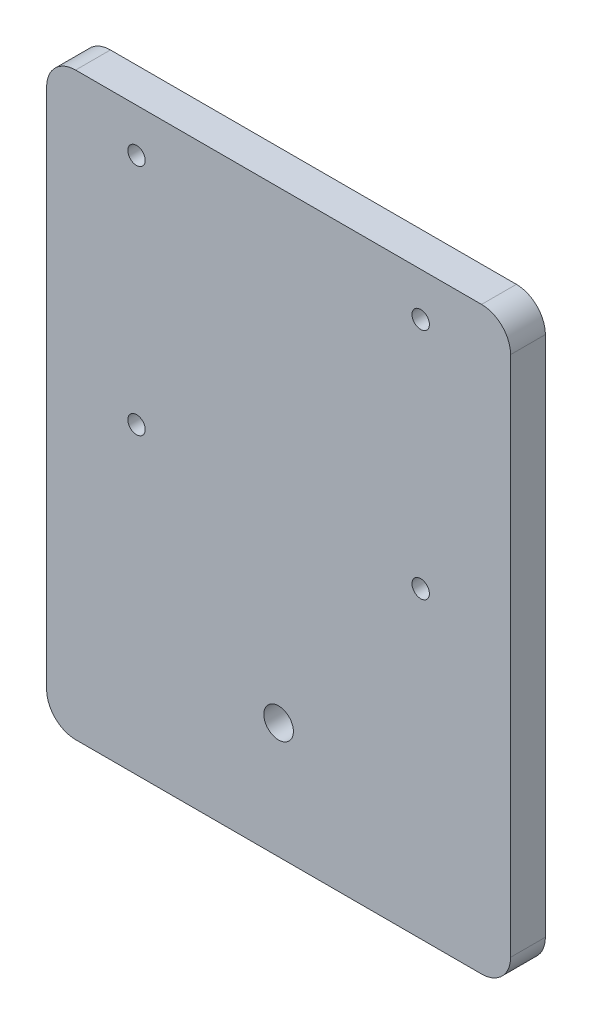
ISO-10303-21;
HEADER;
FILE_DESCRIPTION(('STEP AP214'),'2;1');
FILE_NAME('part.step','',(''),(''),'','','');
FILE_SCHEMA(('AUTOMOTIVE_DESIGN { 1 0 10303 214 1 1 1 1 }'));
ENDSEC;
DATA;
#1=APPLICATION_CONTEXT('core data for automotive mechanical design processes');
#2=APPLICATION_PROTOCOL_DEFINITION('international standard','automotive_design',2000,#1);
#3=PRODUCT_CONTEXT('',#1,'mechanical');
#4=PRODUCT('Part','Part','',(#3));
#5=PRODUCT_RELATED_PRODUCT_CATEGORY('part','',(#4));
#6=PRODUCT_DEFINITION_FORMATION('','',#4);
#7=PRODUCT_DEFINITION_CONTEXT('part definition',#1,'design');
#8=PRODUCT_DEFINITION('design','',#6,#7);
#9=PRODUCT_DEFINITION_SHAPE('','',#8);
#10=(LENGTH_UNIT() NAMED_UNIT(*) SI_UNIT(.MILLI.,.METRE.));
#11=(NAMED_UNIT(*) PLANE_ANGLE_UNIT() SI_UNIT($,.RADIAN.));
#12=(NAMED_UNIT(*) SI_UNIT($,.STERADIAN.) SOLID_ANGLE_UNIT());
#13=UNCERTAINTY_MEASURE_WITH_UNIT(LENGTH_MEASURE(1.E-05),#10,'distance_accuracy_value','');
#14=(GEOMETRIC_REPRESENTATION_CONTEXT(3) GLOBAL_UNCERTAINTY_ASSIGNED_CONTEXT((#13)) GLOBAL_UNIT_ASSIGNED_CONTEXT((#10,
#11,#12)) REPRESENTATION_CONTEXT('',''));
#15=CARTESIAN_POINT('',(0.,0.,0.));
#16=DIRECTION('',(0.,0.,1.));
#17=DIRECTION('',(1.,0.,0.));
#18=AXIS2_PLACEMENT_3D('',#15,#16,#17);
#19=CARTESIAN_POINT('',(40.,-50.,6.));
#20=DIRECTION('',(-1.,0.,0.));
#21=DIRECTION('',(0.,0.,1.));
#22=AXIS2_PLACEMENT_3D('',#19,#20,#21);
#23=PLANE('',#22);
#24=DIRECTION('',(0.,1.,0.));
#25=VECTOR('',#24,1.);
#26=CARTESIAN_POINT('',(40.,-50.,6.));
#27=LINE('',#26,#25);
#28=CARTESIAN_POINT('',(40.,-45.,6.));
#29=VERTEX_POINT('',#28);
#30=CARTESIAN_POINT('',(40.,45.,6.));
#31=VERTEX_POINT('',#30);
#32=EDGE_CURVE('E128',#29,#31,#27,.T.);
#33=ORIENTED_EDGE('',*,*,#32,.F.);
#34=DIRECTION('',(0.,0.,-1.));
#35=VECTOR('',#34,1.);
#36=CARTESIAN_POINT('',(40.,-45.,6.));
#37=LINE('',#36,#35);
#38=CARTESIAN_POINT('',(40.,-45.,0.));
#39=VERTEX_POINT('',#38);
#40=EDGE_CURVE('E11',#29,#39,#37,.T.);
#41=ORIENTED_EDGE('',*,*,#40,.T.);
#42=DIRECTION('',(0.,1.,0.));
#43=VECTOR('',#42,1.);
#44=CARTESIAN_POINT('',(40.,-50.,0.));
#45=LINE('',#44,#43);
#46=CARTESIAN_POINT('',(40.,45.,0.));
#47=VERTEX_POINT('',#46);
#48=EDGE_CURVE('E130',#39,#47,#45,.T.);
#49=ORIENTED_EDGE('',*,*,#48,.T.);
#50=DIRECTION('',(0.,0.,-1.));
#51=VECTOR('',#50,1.);
#52=CARTESIAN_POINT('',(40.,45.,6.));
#53=LINE('',#52,#51);
#54=EDGE_CURVE('E41',#47,#31,#53,.F.);
#55=ORIENTED_EDGE('',*,*,#54,.T.);
#56=EDGE_LOOP('',(#33,#41,#49,#55));
#57=FACE_BOUND('',#56,.T.);
#58=ADVANCED_FACE('F33',(#57),#23,.F.);
#59=CARTESIAN_POINT('',(-40.,50.,6.));
#60=DIRECTION('',(0.,-1.,0.));
#61=DIRECTION('',(0.,0.,-1.));
#62=AXIS2_PLACEMENT_3D('',#59,#60,#61);
#63=PLANE('',#62);
#64=DIRECTION('',(-1.,0.,0.));
#65=VECTOR('',#64,1.);
#66=CARTESIAN_POINT('',(-40.,50.,0.));
#67=LINE('',#66,#65);
#68=CARTESIAN_POINT('',(35.,50.,0.));
#69=VERTEX_POINT('',#68);
#70=CARTESIAN_POINT('',(-35.,50.,0.));
#71=VERTEX_POINT('',#70);
#72=EDGE_CURVE('E126',#69,#71,#67,.T.);
#73=ORIENTED_EDGE('',*,*,#72,.T.);
#74=DIRECTION('',(0.,0.,-1.));
#75=VECTOR('',#74,1.);
#76=CARTESIAN_POINT('',(-35.,50.,6.));
#77=LINE('',#76,#75);
#78=CARTESIAN_POINT('',(-35.,50.,6.));
#79=VERTEX_POINT('',#78);
#80=EDGE_CURVE('E105',#71,#79,#77,.F.);
#81=ORIENTED_EDGE('',*,*,#80,.T.);
#82=DIRECTION('',(-1.,0.,0.));
#83=VECTOR('',#82,1.);
#84=CARTESIAN_POINT('',(-40.,50.,6.));
#85=LINE('',#84,#83);
#86=CARTESIAN_POINT('',(35.,50.,6.));
#87=VERTEX_POINT('',#86);
#88=EDGE_CURVE('E166',#87,#79,#85,.T.);
#89=ORIENTED_EDGE('',*,*,#88,.F.);
#90=DIRECTION('',(0.,0.,-1.));
#91=VECTOR('',#90,1.);
#92=CARTESIAN_POINT('',(35.,50.,6.));
#93=LINE('',#92,#91);
#94=EDGE_CURVE('E110',#87,#69,#93,.T.);
#95=ORIENTED_EDGE('',*,*,#94,.T.);
#96=EDGE_LOOP('',(#73,#81,#89,#95));
#97=FACE_BOUND('',#96,.T.);
#98=ADVANCED_FACE('F170',(#97),#63,.F.);
#99=CARTESIAN_POINT('',(-40.,-50.,6.));
#100=DIRECTION('',(1.,0.,0.));
#101=DIRECTION('',(0.,0.,-1.));
#102=AXIS2_PLACEMENT_3D('',#99,#100,#101);
#103=PLANE('',#102);
#104=DIRECTION('',(0.,-1.,0.));
#105=VECTOR('',#104,1.);
#106=CARTESIAN_POINT('',(-40.,-50.,6.));
#107=LINE('',#106,#105);
#108=CARTESIAN_POINT('',(-40.,45.,6.));
#109=VERTEX_POINT('',#108);
#110=CARTESIAN_POINT('',(-40.,-45.,6.));
#111=VERTEX_POINT('',#110);
#112=EDGE_CURVE('E119',#109,#111,#107,.T.);
#113=ORIENTED_EDGE('',*,*,#112,.F.);
#114=DIRECTION('',(0.,0.,-1.));
#115=VECTOR('',#114,1.);
#116=CARTESIAN_POINT('',(-40.,45.,6.));
#117=LINE('',#116,#115);
#118=CARTESIAN_POINT('',(-40.,45.,0.));
#119=VERTEX_POINT('',#118);
#120=EDGE_CURVE('E104',#109,#119,#117,.T.);
#121=ORIENTED_EDGE('',*,*,#120,.T.);
#122=DIRECTION('',(0.,-1.,0.));
#123=VECTOR('',#122,1.);
#124=CARTESIAN_POINT('',(-40.,-50.,0.));
#125=LINE('',#124,#123);
#126=CARTESIAN_POINT('',(-40.,-45.,0.));
#127=VERTEX_POINT('',#126);
#128=EDGE_CURVE('E117',#119,#127,#125,.T.);
#129=ORIENTED_EDGE('',*,*,#128,.T.);
#130=DIRECTION('',(0.,0.,-1.));
#131=VECTOR('',#130,1.);
#132=CARTESIAN_POINT('',(-40.,-45.,6.));
#133=LINE('',#132,#131);
#134=EDGE_CURVE('E121',#127,#111,#133,.F.);
#135=ORIENTED_EDGE('',*,*,#134,.T.);
#136=EDGE_LOOP('',(#113,#121,#129,#135));
#137=FACE_BOUND('',#136,.T.);
#138=ADVANCED_FACE('F116',(#137),#103,.F.);
#139=CARTESIAN_POINT('',(-40.,-50.,6.));
#140=DIRECTION('',(0.,1.,0.));
#141=DIRECTION('',(0.,0.,1.));
#142=AXIS2_PLACEMENT_3D('',#139,#140,#141);
#143=PLANE('',#142);
#144=DIRECTION('',(1.,0.,0.));
#145=VECTOR('',#144,1.);
#146=CARTESIAN_POINT('',(-40.,-50.,6.));
#147=LINE('',#146,#145);
#148=CARTESIAN_POINT('',(-35.,-50.,6.));
#149=VERTEX_POINT('',#148);
#150=CARTESIAN_POINT('',(35.,-50.,6.));
#151=VERTEX_POINT('',#150);
#152=EDGE_CURVE('E134',#149,#151,#147,.T.);
#153=ORIENTED_EDGE('',*,*,#152,.F.);
#154=DIRECTION('',(0.,0.,-1.));
#155=VECTOR('',#154,1.);
#156=CARTESIAN_POINT('',(-35.,-50.,6.));
#157=LINE('',#156,#155);
#158=CARTESIAN_POINT('',(-35.,-50.,0.));
#159=VERTEX_POINT('',#158);
#160=EDGE_CURVE('E151',#149,#159,#157,.T.);
#161=ORIENTED_EDGE('',*,*,#160,.T.);
#162=DIRECTION('',(1.,0.,0.));
#163=VECTOR('',#162,1.);
#164=CARTESIAN_POINT('',(-40.,-50.,0.));
#165=LINE('',#164,#163);
#166=CARTESIAN_POINT('',(35.,-50.,0.));
#167=VERTEX_POINT('',#166);
#168=EDGE_CURVE('E125',#159,#167,#165,.T.);
#169=ORIENTED_EDGE('',*,*,#168,.T.);
#170=DIRECTION('',(0.,0.,-1.));
#171=VECTOR('',#170,1.);
#172=CARTESIAN_POINT('',(35.,-50.,6.));
#173=LINE('',#172,#171);
#174=EDGE_CURVE('E48',#167,#151,#173,.F.);
#175=ORIENTED_EDGE('',*,*,#174,.T.);
#176=EDGE_LOOP('',(#153,#161,#169,#175));
#177=FACE_BOUND('',#176,.T.);
#178=ADVANCED_FACE('F228',(#177),#143,.F.);
#179=CARTESIAN_POINT('',(0.,0.,6.));
#180=DIRECTION('',(0.,0.,-1.));
#181=DIRECTION('',(-1.,0.,0.));
#182=AXIS2_PLACEMENT_3D('',#179,#180,#181);
#183=PLANE('',#182);
#184=CARTESIAN_POINT('',(-24.4999999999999,42.5011886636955,6.));
#185=DIRECTION('',(0.,0.,-1.));
#186=DIRECTION('',(-1.,0.,0.));
#187=AXIS2_PLACEMENT_3D('',#184,#185,#186);
#188=CIRCLE('',#187,1.5);
#189=CARTESIAN_POINT('',(-25.9999999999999,42.5011886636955,6.));
#190=VERTEX_POINT('',#189);
#191=EDGE_CURVE('E187',#190,#190,#188,.T.);
#192=ORIENTED_EDGE('',*,*,#191,.T.);
#193=EDGE_LOOP('',(#192));
#194=FACE_BOUND('',#193,.T.);
#195=CARTESIAN_POINT('',(24.5,2.29881133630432,6.));
#196=DIRECTION('',(0.,0.,-1.));
#197=DIRECTION('',(-1.,0.,0.));
#198=AXIS2_PLACEMENT_3D('',#195,#196,#197);
#199=CIRCLE('',#198,1.5);
#200=CARTESIAN_POINT('',(23.,2.29881133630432,6.));
#201=VERTEX_POINT('',#200);
#202=EDGE_CURVE('E190',#201,#201,#199,.T.);
#203=ORIENTED_EDGE('',*,*,#202,.T.);
#204=EDGE_LOOP('',(#203));
#205=FACE_BOUND('',#204,.T.);
#206=CARTESIAN_POINT('',(24.5,42.5011886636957,6.));
#207=DIRECTION('',(0.,0.,-1.));
#208=DIRECTION('',(-1.,0.,0.));
#209=AXIS2_PLACEMENT_3D('',#206,#207,#208);
#210=CIRCLE('',#209,1.5);
#211=CARTESIAN_POINT('',(23.,42.5011886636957,6.));
#212=VERTEX_POINT('',#211);
#213=EDGE_CURVE('E193',#212,#212,#210,.T.);
#214=ORIENTED_EDGE('',*,*,#213,.T.);
#215=EDGE_LOOP('',(#214));
#216=FACE_BOUND('',#215,.T.);
#217=CARTESIAN_POINT('',(-24.5,2.29881133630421,6.));
#218=DIRECTION('',(0.,0.,-1.));
#219=DIRECTION('',(-1.,0.,0.));
#220=AXIS2_PLACEMENT_3D('',#217,#218,#219);
#221=CIRCLE('',#220,1.5);
#222=CARTESIAN_POINT('',(-26.,2.29881133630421,6.));
#223=VERTEX_POINT('',#222);
#224=EDGE_CURVE('E180',#223,#223,#221,.T.);
#225=ORIENTED_EDGE('',*,*,#224,.T.);
#226=EDGE_LOOP('',(#225));
#227=FACE_BOUND('',#226,.T.);
#228=CARTESIAN_POINT('',(0.,-30.,6.));
#229=DIRECTION('',(0.,0.,1.));
#230=DIRECTION('',(1.,0.,0.));
#231=AXIS2_PLACEMENT_3D('',#228,#229,#230);
#232=CIRCLE('',#231,2.55);
#233=CARTESIAN_POINT('',(2.55,-30.,6.));
#234=VERTEX_POINT('',#233);
#235=EDGE_CURVE('E173',#234,#234,#232,.T.);
#236=ORIENTED_EDGE('',*,*,#235,.F.);
#237=EDGE_LOOP('',(#236));
#238=FACE_BOUND('',#237,.T.);
#239=ORIENTED_EDGE('',*,*,#88,.T.);
#240=CARTESIAN_POINT('',(-35.,45.,6.));
#241=DIRECTION('',(0.,0.,-1.));
#242=DIRECTION('',(-1.,0.,0.));
#243=AXIS2_PLACEMENT_3D('',#240,#241,#242);
#244=CIRCLE('',#243,5.);
#245=EDGE_CURVE('E148',#79,#109,#244,.F.);
#246=ORIENTED_EDGE('',*,*,#245,.T.);
#247=ORIENTED_EDGE('',*,*,#112,.T.);
#248=CARTESIAN_POINT('',(-35.,-45.,6.));
#249=DIRECTION('',(0.,0.,-1.));
#250=DIRECTION('',(-1.,0.,0.));
#251=AXIS2_PLACEMENT_3D('',#248,#249,#250);
#252=CIRCLE('',#251,5.);
#253=EDGE_CURVE('E55',#111,#149,#252,.F.);
#254=ORIENTED_EDGE('',*,*,#253,.T.);
#255=ORIENTED_EDGE('',*,*,#152,.T.);
#256=CARTESIAN_POINT('',(35.,-45.,6.));
#257=DIRECTION('',(0.,0.,-1.));
#258=DIRECTION('',(-1.,0.,0.));
#259=AXIS2_PLACEMENT_3D('',#256,#257,#258);
#260=CIRCLE('',#259,5.);
#261=EDGE_CURVE('E145',#151,#29,#260,.F.);
#262=ORIENTED_EDGE('',*,*,#261,.T.);
#263=ORIENTED_EDGE('',*,*,#32,.T.);
#264=CARTESIAN_POINT('',(35.,45.,6.));
#265=DIRECTION('',(0.,0.,-1.));
#266=DIRECTION('',(-1.,0.,0.));
#267=AXIS2_PLACEMENT_3D('',#264,#265,#266);
#268=CIRCLE('',#267,5.);
#269=EDGE_CURVE('E143',#31,#87,#268,.F.);
#270=ORIENTED_EDGE('',*,*,#269,.T.);
#271=EDGE_LOOP('',(#239,#246,#247,#254,#255,#262,#263,#270));
#272=FACE_BOUND('',#271,.T.);
#273=ADVANCED_FACE('F163',(#194,#205,#216,#227,#238,#272),#183,.F.);
#274=CARTESIAN_POINT('',(0.,0.,0.));
#275=DIRECTION('',(0.,0.,-1.));
#276=DIRECTION('',(-1.,0.,0.));
#277=AXIS2_PLACEMENT_3D('',#274,#275,#276);
#278=PLANE('',#277);
#279=CARTESIAN_POINT('',(-24.4999999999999,42.5011886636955,0.));
#280=DIRECTION('',(0.,0.,-1.));
#281=DIRECTION('',(-1.,0.,0.));
#282=AXIS2_PLACEMENT_3D('',#279,#280,#281);
#283=CIRCLE('',#282,1.5);
#284=CARTESIAN_POINT('',(-25.9999999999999,42.5011886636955,0.));
#285=VERTEX_POINT('',#284);
#286=EDGE_CURVE('E196',#285,#285,#283,.T.);
#287=ORIENTED_EDGE('',*,*,#286,.F.);
#288=EDGE_LOOP('',(#287));
#289=FACE_BOUND('',#288,.T.);
#290=CARTESIAN_POINT('',(24.5,2.29881133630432,0.));
#291=DIRECTION('',(0.,0.,-1.));
#292=DIRECTION('',(-1.,0.,0.));
#293=AXIS2_PLACEMENT_3D('',#290,#291,#292);
#294=CIRCLE('',#293,1.5);
#295=CARTESIAN_POINT('',(23.,2.29881133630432,0.));
#296=VERTEX_POINT('',#295);
#297=EDGE_CURVE('E200',#296,#296,#294,.T.);
#298=ORIENTED_EDGE('',*,*,#297,.F.);
#299=EDGE_LOOP('',(#298));
#300=FACE_BOUND('',#299,.T.);
#301=CARTESIAN_POINT('',(24.5,42.5011886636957,0.));
#302=DIRECTION('',(0.,0.,-1.));
#303=DIRECTION('',(-1.,0.,0.));
#304=AXIS2_PLACEMENT_3D('',#301,#302,#303);
#305=CIRCLE('',#304,1.5);
#306=CARTESIAN_POINT('',(23.,42.5011886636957,0.));
#307=VERTEX_POINT('',#306);
#308=EDGE_CURVE('E197',#307,#307,#305,.T.);
#309=ORIENTED_EDGE('',*,*,#308,.F.);
#310=EDGE_LOOP('',(#309));
#311=FACE_BOUND('',#310,.T.);
#312=CARTESIAN_POINT('',(-24.5,2.29881133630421,0.));
#313=DIRECTION('',(0.,0.,-1.));
#314=DIRECTION('',(-1.,0.,0.));
#315=AXIS2_PLACEMENT_3D('',#312,#313,#314);
#316=CIRCLE('',#315,1.5);
#317=CARTESIAN_POINT('',(-26.,2.29881133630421,0.));
#318=VERTEX_POINT('',#317);
#319=EDGE_CURVE('E184',#318,#318,#316,.T.);
#320=ORIENTED_EDGE('',*,*,#319,.F.);
#321=EDGE_LOOP('',(#320));
#322=FACE_BOUND('',#321,.T.);
#323=CARTESIAN_POINT('',(0.,-30.,0.));
#324=DIRECTION('',(0.,0.,1.));
#325=DIRECTION('',(1.,0.,0.));
#326=AXIS2_PLACEMENT_3D('',#323,#324,#325);
#327=CIRCLE('',#326,2.55);
#328=CARTESIAN_POINT('',(2.55,-30.,0.));
#329=VERTEX_POINT('',#328);
#330=EDGE_CURVE('E171',#329,#329,#327,.T.);
#331=ORIENTED_EDGE('',*,*,#330,.T.);
#332=EDGE_LOOP('',(#331));
#333=FACE_BOUND('',#332,.T.);
#334=ORIENTED_EDGE('',*,*,#128,.F.);
#335=CARTESIAN_POINT('',(-35.,45.,0.));
#336=DIRECTION('',(0.,0.,-1.));
#337=DIRECTION('',(-1.,0.,0.));
#338=AXIS2_PLACEMENT_3D('',#335,#336,#337);
#339=CIRCLE('',#338,5.);
#340=EDGE_CURVE('E100',#119,#71,#339,.T.);
#341=ORIENTED_EDGE('',*,*,#340,.T.);
#342=ORIENTED_EDGE('',*,*,#72,.F.);
#343=CARTESIAN_POINT('',(35.,45.,0.));
#344=DIRECTION('',(0.,0.,-1.));
#345=DIRECTION('',(-1.,0.,0.));
#346=AXIS2_PLACEMENT_3D('',#343,#344,#345);
#347=CIRCLE('',#346,5.);
#348=EDGE_CURVE('E120',#69,#47,#347,.T.);
#349=ORIENTED_EDGE('',*,*,#348,.T.);
#350=ORIENTED_EDGE('',*,*,#48,.F.);
#351=CARTESIAN_POINT('',(35.,-45.,0.));
#352=DIRECTION('',(0.,0.,-1.));
#353=DIRECTION('',(-1.,0.,0.));
#354=AXIS2_PLACEMENT_3D('',#351,#352,#353);
#355=CIRCLE('',#354,5.);
#356=EDGE_CURVE('E137',#39,#167,#355,.T.);
#357=ORIENTED_EDGE('',*,*,#356,.T.);
#358=ORIENTED_EDGE('',*,*,#168,.F.);
#359=CARTESIAN_POINT('',(-35.,-45.,0.));
#360=DIRECTION('',(0.,0.,-1.));
#361=DIRECTION('',(-1.,0.,0.));
#362=AXIS2_PLACEMENT_3D('',#359,#360,#361);
#363=CIRCLE('',#362,5.);
#364=EDGE_CURVE('E111',#159,#127,#363,.T.);
#365=ORIENTED_EDGE('',*,*,#364,.T.);
#366=EDGE_LOOP('',(#334,#341,#342,#349,#350,#357,#358,#365));
#367=FACE_BOUND('',#366,.T.);
#368=ADVANCED_FACE('F123',(#289,#300,#311,#322,#333,#367),#278,.T.);
#369=CARTESIAN_POINT('',(-35.,45.,6.));
#370=DIRECTION('',(0.,0.,-1.));
#371=DIRECTION('',(-1.,0.,0.));
#372=AXIS2_PLACEMENT_3D('',#369,#370,#371);
#373=CYLINDRICAL_SURFACE('',#372,5.);
#374=ORIENTED_EDGE('',*,*,#245,.F.);
#375=ORIENTED_EDGE('',*,*,#80,.F.);
#376=ORIENTED_EDGE('',*,*,#340,.F.);
#377=ORIENTED_EDGE('',*,*,#120,.F.);
#378=EDGE_LOOP('',(#374,#375,#376,#377));
#379=FACE_BOUND('',#378,.T.);
#380=ADVANCED_FACE('F103',(#379),#373,.T.);
#381=CARTESIAN_POINT('',(-35.,-45.,6.));
#382=DIRECTION('',(0.,0.,-1.));
#383=DIRECTION('',(-1.,0.,0.));
#384=AXIS2_PLACEMENT_3D('',#381,#382,#383);
#385=CYLINDRICAL_SURFACE('',#384,5.);
#386=ORIENTED_EDGE('',*,*,#253,.F.);
#387=ORIENTED_EDGE('',*,*,#134,.F.);
#388=ORIENTED_EDGE('',*,*,#364,.F.);
#389=ORIENTED_EDGE('',*,*,#160,.F.);
#390=EDGE_LOOP('',(#386,#387,#388,#389));
#391=FACE_BOUND('',#390,.T.);
#392=ADVANCED_FACE('F247',(#391),#385,.T.);
#393=CARTESIAN_POINT('',(35.,-45.,6.));
#394=DIRECTION('',(0.,0.,-1.));
#395=DIRECTION('',(-1.,0.,0.));
#396=AXIS2_PLACEMENT_3D('',#393,#394,#395);
#397=CYLINDRICAL_SURFACE('',#396,5.);
#398=ORIENTED_EDGE('',*,*,#261,.F.);
#399=ORIENTED_EDGE('',*,*,#174,.F.);
#400=ORIENTED_EDGE('',*,*,#356,.F.);
#401=ORIENTED_EDGE('',*,*,#40,.F.);
#402=EDGE_LOOP('',(#398,#399,#400,#401));
#403=FACE_BOUND('',#402,.T.);
#404=ADVANCED_FACE('F249',(#403),#397,.T.);
#405=CARTESIAN_POINT('',(35.,45.,6.));
#406=DIRECTION('',(0.,0.,-1.));
#407=DIRECTION('',(-1.,0.,0.));
#408=AXIS2_PLACEMENT_3D('',#405,#406,#407);
#409=CYLINDRICAL_SURFACE('',#408,5.);
#410=ORIENTED_EDGE('',*,*,#269,.F.);
#411=ORIENTED_EDGE('',*,*,#54,.F.);
#412=ORIENTED_EDGE('',*,*,#348,.F.);
#413=ORIENTED_EDGE('',*,*,#94,.F.);
#414=EDGE_LOOP('',(#410,#411,#412,#413));
#415=FACE_BOUND('',#414,.T.);
#416=ADVANCED_FACE('F35',(#415),#409,.T.);
#417=CARTESIAN_POINT('',(0.,-30.,0.));
#418=DIRECTION('',(0.,0.,1.));
#419=DIRECTION('',(1.,0.,0.));
#420=AXIS2_PLACEMENT_3D('',#417,#418,#419);
#421=CYLINDRICAL_SURFACE('',#420,2.55);
#422=ORIENTED_EDGE('',*,*,#330,.F.);
#423=EDGE_LOOP('',(#422));
#424=FACE_BOUND('',#423,.T.);
#425=ORIENTED_EDGE('',*,*,#235,.T.);
#426=EDGE_LOOP('',(#425));
#427=FACE_BOUND('',#426,.T.);
#428=ADVANCED_FACE('F220',(#424,#427),#421,.F.);
#429=CARTESIAN_POINT('',(-24.5,2.29881133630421,10.));
#430=DIRECTION('',(0.,0.,-1.));
#431=DIRECTION('',(-1.,0.,0.));
#432=AXIS2_PLACEMENT_3D('',#429,#430,#431);
#433=CYLINDRICAL_SURFACE('',#432,1.5);
#434=ORIENTED_EDGE('',*,*,#319,.T.);
#435=EDGE_LOOP('',(#434));
#436=FACE_BOUND('',#435,.T.);
#437=ORIENTED_EDGE('',*,*,#224,.F.);
#438=EDGE_LOOP('',(#437));
#439=FACE_BOUND('',#438,.T.);
#440=ADVANCED_FACE('F223',(#436,#439),#433,.F.);
#441=CARTESIAN_POINT('',(24.5,42.5011886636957,10.));
#442=DIRECTION('',(0.,0.,-1.));
#443=DIRECTION('',(-1.,0.,0.));
#444=AXIS2_PLACEMENT_3D('',#441,#442,#443);
#445=CYLINDRICAL_SURFACE('',#444,1.5);
#446=ORIENTED_EDGE('',*,*,#308,.T.);
#447=EDGE_LOOP('',(#446));
#448=FACE_BOUND('',#447,.T.);
#449=ORIENTED_EDGE('',*,*,#213,.F.);
#450=EDGE_LOOP('',(#449));
#451=FACE_BOUND('',#450,.T.);
#452=ADVANCED_FACE('F267',(#448,#451),#445,.F.);
#453=CARTESIAN_POINT('',(24.5,2.29881133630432,10.));
#454=DIRECTION('',(0.,0.,-1.));
#455=DIRECTION('',(-1.,0.,0.));
#456=AXIS2_PLACEMENT_3D('',#453,#454,#455);
#457=CYLINDRICAL_SURFACE('',#456,1.5);
#458=ORIENTED_EDGE('',*,*,#297,.T.);
#459=EDGE_LOOP('',(#458));
#460=FACE_BOUND('',#459,.T.);
#461=ORIENTED_EDGE('',*,*,#202,.F.);
#462=EDGE_LOOP('',(#461));
#463=FACE_BOUND('',#462,.T.);
#464=ADVANCED_FACE('F275',(#460,#463),#457,.F.);
#465=CARTESIAN_POINT('',(-24.4999999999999,42.5011886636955,10.));
#466=DIRECTION('',(0.,0.,-1.));
#467=DIRECTION('',(-1.,0.,0.));
#468=AXIS2_PLACEMENT_3D('',#465,#466,#467);
#469=CYLINDRICAL_SURFACE('',#468,1.5);
#470=ORIENTED_EDGE('',*,*,#286,.T.);
#471=EDGE_LOOP('',(#470));
#472=FACE_BOUND('',#471,.T.);
#473=ORIENTED_EDGE('',*,*,#191,.F.);
#474=EDGE_LOOP('',(#473));
#475=FACE_BOUND('',#474,.T.);
#476=ADVANCED_FACE('F206',(#472,#475),#469,.F.);
#477=CLOSED_SHELL('',(#58,#98,#138,#178,#273,#368,#380,#392,#404,#416,#428,#440,#452,#464,#476));
#478=MANIFOLD_SOLID_BREP('B2',#477);
#479=ADVANCED_BREP_SHAPE_REPRESENTATION('',(#18,#478),#14);
#480=SHAPE_DEFINITION_REPRESENTATION(#9,#479);
ENDSEC;
END-ISO-10303-21;
